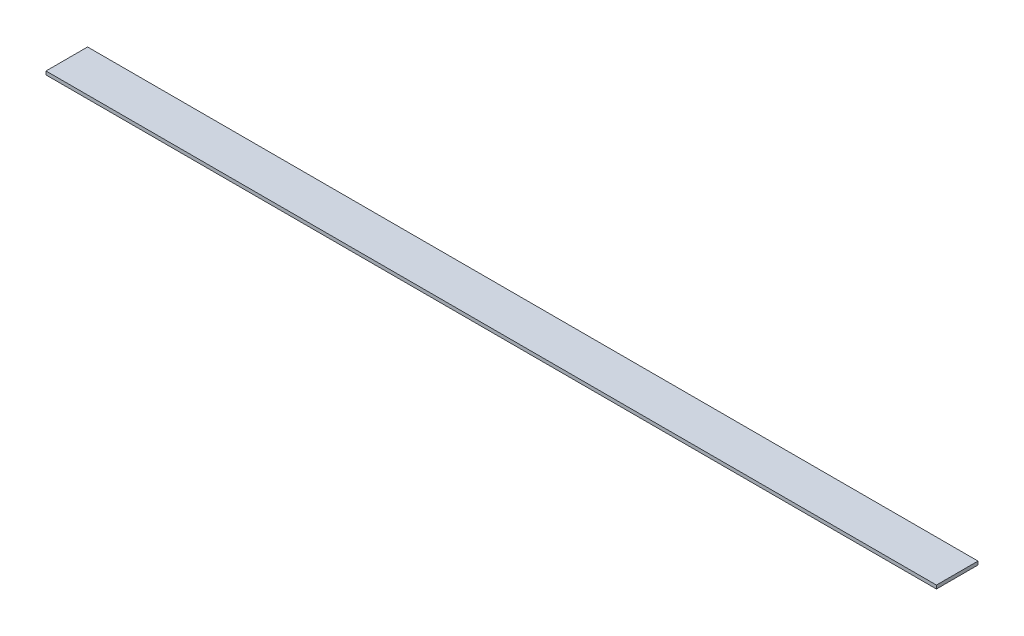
from build123d import *

# Parameters (mm, degrees)
SKETCH1_W           = 1631.95
SKETCH1_H           = 76.2
BOSS_EXTRUDE1_DEPTH = 6.35


with BuildPart() as part:
    # Sketch1 → Boss-Extrude1 (new body)
    with BuildSketch(Plane(origin=(0, 0, 0), x_dir=(1, 0, 0), z_dir=(0, 1, 0))):
        Rectangle(SKETCH1_W, SKETCH1_H)
    extrude(amount=BOSS_EXTRUDE1_DEPTH)


solid = part.part
